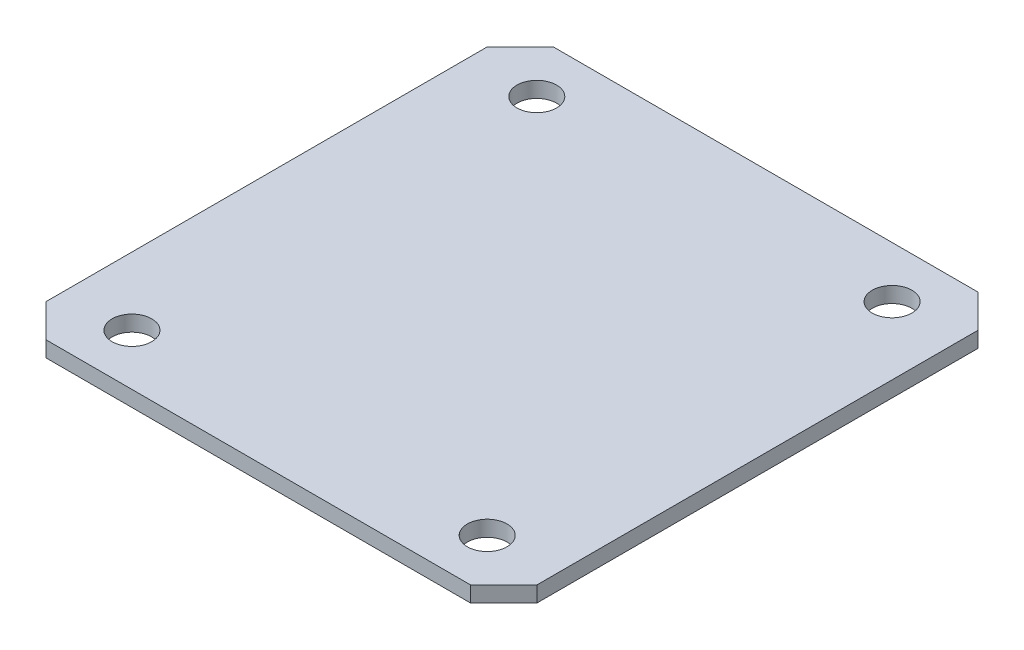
from build123d import *

# Parameters (mm, degrees)
SKETCH1_W            = 29.7
SKETCH1_H            = 30.7
BOSS_EXTRUDE1_DEPTH  = 0.95
M2_CLEARANCE_HOLE1_D = 2.4
LPATTERN1_COUNT      = 2
LPATTERN1_PITCH      = 21.5
LPATTERN1_COUNT_DIR2 = 2
LPATTERN1_PITCH_DIR2 = 24.5
CHAMFER1_SIZE        = 2


with BuildPart() as part:
    # Sketch1 → Boss-Extrude1 (new body)
    with BuildSketch(Plane(origin=(0, 0, 0), x_dir=(1, 0, 0), z_dir=(0, 1, 0))):
        Rectangle(SKETCH1_W, SKETCH1_H)
    extrude(amount=BOSS_EXTRUDE1_DEPTH)

    # M2 Clearance Hole1 (through all)
    with Locations(Plane(origin=(0, 0.95, 0), x_dir=(-1, 0, 0), z_dir=(0, 1, 0))):
        with Locations((10.75, 12.25)):
            m2_clearance_hole1 = Hole(M2_CLEARANCE_HOLE1_D / 2)

    # LPattern1: M2 Clearance Hole1 2 × 2
    with Locations(*[(i * LPATTERN1_PITCH, 0, -j * LPATTERN1_PITCH_DIR2) for i in range(LPATTERN1_COUNT) for j in range(LPATTERN1_COUNT_DIR2) if (i, j) != (0, 0)]):
        add(m2_clearance_hole1, mode=Mode.SUBTRACT)

    # Chamfer1
    chamfer1_edges = [part.edges().sort_by_distance(p)[0] for p in [
        (-14.85, 0.475, -15.35),
        (14.85, 0.475, -15.35),
        (14.85, 0.475, 15.35),
        (-14.85, 0.475, 15.35),
    ]]
    chamfer(chamfer1_edges, length=CHAMFER1_SIZE)


solid = part.part
